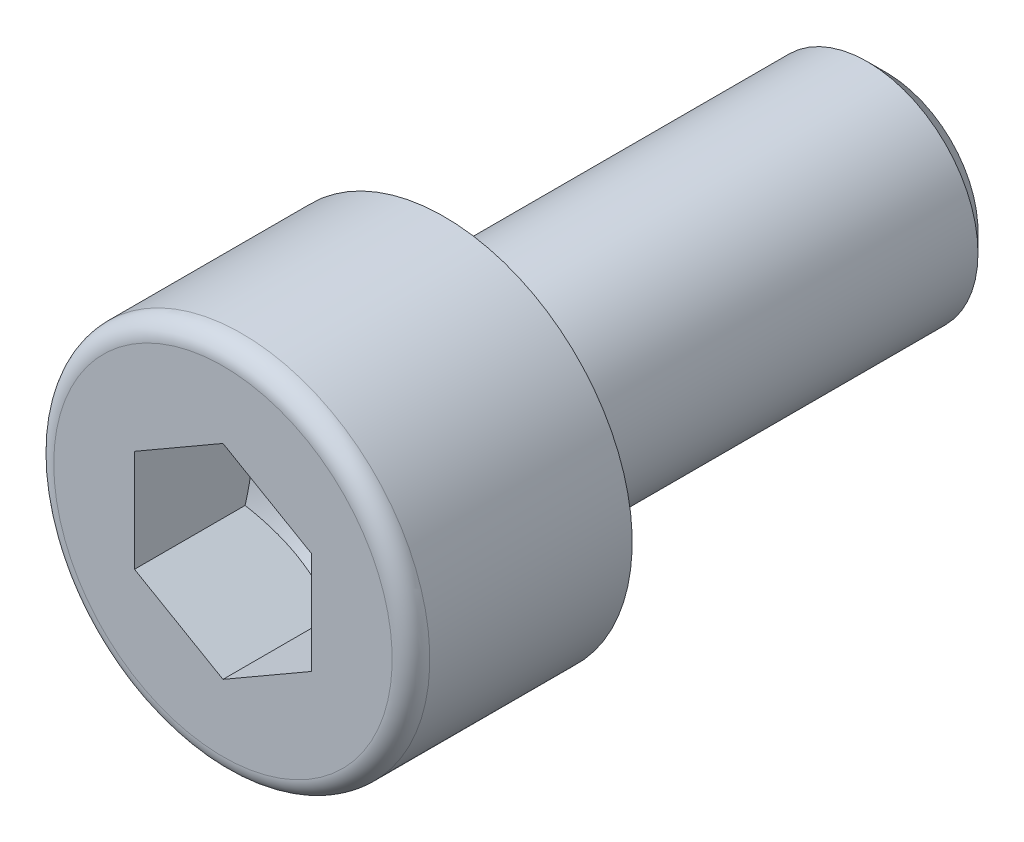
ISO-10303-21;
HEADER;
FILE_DESCRIPTION(('STEP AP214'),'2;1');
FILE_NAME('part.step','',(''),(''),'','','');
FILE_SCHEMA(('AUTOMOTIVE_DESIGN { 1 0 10303 214 1 1 1 1 }'));
ENDSEC;
DATA;
#1=APPLICATION_CONTEXT('core data for automotive mechanical design processes');
#2=APPLICATION_PROTOCOL_DEFINITION('international standard','automotive_design',2000,#1);
#3=PRODUCT_CONTEXT('',#1,'mechanical');
#4=PRODUCT('Part','Part','',(#3));
#5=PRODUCT_RELATED_PRODUCT_CATEGORY('part','',(#4));
#6=PRODUCT_DEFINITION_FORMATION('','',#4);
#7=PRODUCT_DEFINITION_CONTEXT('part definition',#1,'design');
#8=PRODUCT_DEFINITION('design','',#6,#7);
#9=PRODUCT_DEFINITION_SHAPE('','',#8);
#10=(LENGTH_UNIT() NAMED_UNIT(*) SI_UNIT(.MILLI.,.METRE.));
#11=(NAMED_UNIT(*) PLANE_ANGLE_UNIT() SI_UNIT($,.RADIAN.));
#12=(NAMED_UNIT(*) SI_UNIT($,.STERADIAN.) SOLID_ANGLE_UNIT());
#13=UNCERTAINTY_MEASURE_WITH_UNIT(LENGTH_MEASURE(1.E-05),#10,'distance_accuracy_value','');
#14=(GEOMETRIC_REPRESENTATION_CONTEXT(3) GLOBAL_UNCERTAINTY_ASSIGNED_CONTEXT((#13)) GLOBAL_UNIT_ASSIGNED_CONTEXT((#10,
#11,#12)) REPRESENTATION_CONTEXT('',''));
#15=CARTESIAN_POINT('',(0.,0.,0.));
#16=DIRECTION('',(0.,0.,1.));
#17=DIRECTION('',(1.,0.,0.));
#18=AXIS2_PLACEMENT_3D('',#15,#16,#17);
#19=CARTESIAN_POINT('',(-2.125,0.,0.));
#20=DIRECTION('',(0.,0.,-1.));
#21=DIRECTION('',(-1.,0.,0.));
#22=AXIS2_PLACEMENT_3D('',#19,#20,#21);
#23=PLANE('',#22);
#24=CARTESIAN_POINT('',(0.,0.,0.));
#25=DIRECTION('',(0.,0.,-1.));
#26=DIRECTION('',(-1.,0.,0.));
#27=AXIS2_PLACEMENT_3D('',#24,#25,#26);
#28=CIRCLE('',#27,4.25);
#29=CARTESIAN_POINT('',(-4.25,0.,0.));
#30=VERTEX_POINT('',#29);
#31=EDGE_CURVE('E9',#30,#30,#28,.T.);
#32=ORIENTED_EDGE('',*,*,#31,.T.);
#33=EDGE_LOOP('',(#32));
#34=FACE_BOUND('',#33,.T.);
#35=CARTESIAN_POINT('',(0.,0.,0.));
#36=DIRECTION('',(0.,0.,1.));
#37=DIRECTION('',(-1.,0.,0.));
#38=AXIS2_PLACEMENT_3D('',#35,#36,#37);
#39=CIRCLE('',#38,2.5);
#40=CARTESIAN_POINT('',(2.5,0.,0.));
#41=VERTEX_POINT('',#40);
#42=EDGE_CURVE('E120',#41,#41,#39,.T.);
#43=ORIENTED_EDGE('',*,*,#42,.T.);
#44=EDGE_LOOP('',(#43));
#45=FACE_BOUND('',#44,.T.);
#46=ADVANCED_FACE('F15',(#34,#45),#23,.T.);
#47=CARTESIAN_POINT('',(0.,0.,2.2875));
#48=DIRECTION('',(0.,0.,1.));
#49=DIRECTION('',(-1.,0.,0.));
#50=AXIS2_PLACEMENT_3D('',#47,#48,#49);
#51=CYLINDRICAL_SURFACE('',#50,4.25);
#52=CARTESIAN_POINT('',(0.,0.,4.575));
#53=DIRECTION('',(0.,0.,-1.));
#54=DIRECTION('',(-1.,0.,0.));
#55=AXIS2_PLACEMENT_3D('',#52,#53,#54);
#56=CIRCLE('',#55,4.25);
#57=CARTESIAN_POINT('',(-4.25,0.,4.575));
#58=VERTEX_POINT('',#57);
#59=EDGE_CURVE('E25',#58,#58,#56,.T.);
#60=ORIENTED_EDGE('',*,*,#59,.T.);
#61=EDGE_LOOP('',(#60));
#62=FACE_BOUND('',#61,.T.);
#63=ORIENTED_EDGE('',*,*,#31,.F.);
#64=EDGE_LOOP('',(#63));
#65=FACE_BOUND('',#64,.T.);
#66=ADVANCED_FACE('F206',(#62,#65),#51,.T.);
#67=CARTESIAN_POINT('',(0.,0.,4.575));
#68=DIRECTION('',(0.,0.,-1.));
#69=DIRECTION('',(0.,-1.,0.));
#70=AXIS2_PLACEMENT_3D('',#67,#68,#69);
#71=TOROIDAL_SURFACE('',#70,3.825,0.425);
#72=CARTESIAN_POINT('',(0.,0.,5.));
#73=DIRECTION('',(0.,0.,-1.));
#74=DIRECTION('',(-1.,0.,0.));
#75=AXIS2_PLACEMENT_3D('',#72,#73,#74);
#76=CIRCLE('',#75,3.825);
#77=CARTESIAN_POINT('',(-3.825,0.,5.));
#78=VERTEX_POINT('',#77);
#79=EDGE_CURVE('E122',#78,#78,#76,.T.);
#80=ORIENTED_EDGE('',*,*,#79,.T.);
#81=EDGE_LOOP('',(#80));
#82=FACE_BOUND('',#81,.T.);
#83=ORIENTED_EDGE('',*,*,#59,.F.);
#84=EDGE_LOOP('',(#83));
#85=FACE_BOUND('',#84,.T.);
#86=ADVANCED_FACE('F211',(#82,#85),#71,.T.);
#87=CARTESIAN_POINT('',(-1.9125,0.,5.));
#88=DIRECTION('',(0.,0.,1.));
#89=DIRECTION('',(1.,0.,0.));
#90=AXIS2_PLACEMENT_3D('',#87,#88,#89);
#91=PLANE('',#90);
#92=ORIENTED_EDGE('',*,*,#79,.F.);
#93=EDGE_LOOP('',(#92));
#94=FACE_BOUND('',#93,.T.);
#95=DIRECTION('',(-0.866025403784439,-0.5,0.));
#96=VECTOR('',#95,1.);
#97=CARTESIAN_POINT('',(0.282812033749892,-2.14611839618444,5.));
#98=LINE('',#97,#96);
#99=CARTESIAN_POINT('',(1.99999906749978,-1.1547,5.));
#100=VERTEX_POINT('',#99);
#101=CARTESIAN_POINT('',(0.,-2.3094,5.));
#102=VERTEX_POINT('',#101);
#103=EDGE_CURVE('E116',#100,#102,#98,.T.);
#104=ORIENTED_EDGE('',*,*,#103,.T.);
#105=DIRECTION('',(-0.866025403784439,0.5,0.));
#106=VECTOR('',#105,1.);
#107=CARTESIAN_POINT('',(-1.71718703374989,-1.31798160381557,5.));
#108=LINE('',#107,#106);
#109=CARTESIAN_POINT('',(-1.99999906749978,-1.1547,5.));
#110=VERTEX_POINT('',#109);
#111=EDGE_CURVE('E76',#102,#110,#108,.T.);
#112=ORIENTED_EDGE('',*,*,#111,.T.);
#113=DIRECTION('',(0.,1.,0.));
#114=VECTOR('',#113,1.);
#115=CARTESIAN_POINT('',(-1.99999906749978,0.,5.));
#116=LINE('',#115,#114);
#117=CARTESIAN_POINT('',(-1.99999906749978,1.1547,5.));
#118=VERTEX_POINT('',#117);
#119=EDGE_CURVE('E19',#110,#118,#116,.T.);
#120=ORIENTED_EDGE('',*,*,#119,.T.);
#121=DIRECTION('',(0.866025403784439,0.5,0.));
#122=VECTOR('',#121,1.);
#123=CARTESIAN_POINT('',(-1.71718703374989,1.31798160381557,5.));
#124=LINE('',#123,#122);
#125=CARTESIAN_POINT('',(0.,2.3094,5.));
#126=VERTEX_POINT('',#125);
#127=EDGE_CURVE('E106',#118,#126,#124,.T.);
#128=ORIENTED_EDGE('',*,*,#127,.T.);
#129=DIRECTION('',(0.866025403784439,-0.5,0.));
#130=VECTOR('',#129,1.);
#131=CARTESIAN_POINT('',(0.282812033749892,2.14611839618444,5.));
#132=LINE('',#131,#130);
#133=CARTESIAN_POINT('',(1.99999906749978,1.1547,5.));
#134=VERTEX_POINT('',#133);
#135=EDGE_CURVE('E101',#126,#134,#132,.T.);
#136=ORIENTED_EDGE('',*,*,#135,.T.);
#137=DIRECTION('',(0.,-1.,0.));
#138=VECTOR('',#137,1.);
#139=CARTESIAN_POINT('',(1.99999906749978,0.,5.));
#140=LINE('',#139,#138);
#141=EDGE_CURVE('E103',#134,#100,#140,.T.);
#142=ORIENTED_EDGE('',*,*,#141,.T.);
#143=EDGE_LOOP('',(#104,#112,#120,#128,#136,#142));
#144=FACE_BOUND('',#143,.T.);
#145=ADVANCED_FACE('F102',(#94,#144),#91,.T.);
#146=CARTESIAN_POINT('',(-1.0335,0.,-10.));
#147=DIRECTION('',(0.,0.,-1.));
#148=DIRECTION('',(-1.,0.,0.));
#149=AXIS2_PLACEMENT_3D('',#146,#147,#148);
#150=PLANE('',#149);
#151=CARTESIAN_POINT('',(0.,0.,-10.));
#152=DIRECTION('',(0.,0.,-1.));
#153=DIRECTION('',(-1.,0.,0.));
#154=AXIS2_PLACEMENT_3D('',#151,#152,#153);
#155=CIRCLE('',#154,2.067);
#156=CARTESIAN_POINT('',(-2.067,0.,-10.));
#157=VERTEX_POINT('',#156);
#158=EDGE_CURVE('E124',#157,#157,#155,.T.);
#159=ORIENTED_EDGE('',*,*,#158,.T.);
#160=EDGE_LOOP('',(#159));
#161=FACE_BOUND('',#160,.T.);
#162=ADVANCED_FACE('F17',(#161),#150,.T.);
#163=CARTESIAN_POINT('',(0.,0.,-9.7835));
#164=DIRECTION('',(0.,0.,1.));
#165=DIRECTION('',(-1.,0.,0.));
#166=AXIS2_PLACEMENT_3D('',#163,#164,#165);
#167=CONICAL_SURFACE('',#166,2.2835,0.785398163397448);
#168=CARTESIAN_POINT('',(0.,0.,-9.567));
#169=DIRECTION('',(0.,0.,-1.));
#170=DIRECTION('',(-1.,0.,0.));
#171=AXIS2_PLACEMENT_3D('',#168,#169,#170);
#172=CIRCLE('',#171,2.5);
#173=CARTESIAN_POINT('',(-2.5,0.,-9.567));
#174=VERTEX_POINT('',#173);
#175=EDGE_CURVE('E130',#174,#174,#172,.T.);
#176=ORIENTED_EDGE('',*,*,#175,.T.);
#177=EDGE_LOOP('',(#176));
#178=FACE_BOUND('',#177,.T.);
#179=ORIENTED_EDGE('',*,*,#158,.F.);
#180=EDGE_LOOP('',(#179));
#181=FACE_BOUND('',#180,.T.);
#182=ADVANCED_FACE('F220',(#178,#181),#167,.T.);
#183=CARTESIAN_POINT('',(0.,0.,-4.2835));
#184=DIRECTION('',(0.,0.,1.));
#185=DIRECTION('',(-1.,0.,0.));
#186=AXIS2_PLACEMENT_3D('',#183,#184,#185);
#187=CYLINDRICAL_SURFACE('',#186,2.5);
#188=ORIENTED_EDGE('',*,*,#42,.F.);
#189=EDGE_LOOP('',(#188));
#190=FACE_BOUND('',#189,.T.);
#191=ORIENTED_EDGE('',*,*,#175,.F.);
#192=EDGE_LOOP('',(#191));
#193=FACE_BOUND('',#192,.T.);
#194=ADVANCED_FACE('F201',(#190,#193),#187,.T.);
#195=CARTESIAN_POINT('',(-0.999999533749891,-1.73205,5.));
#196=DIRECTION('',(-0.5,-0.866025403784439,0.));
#197=DIRECTION('',(-0.866025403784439,0.5,0.));
#198=AXIS2_PLACEMENT_3D('',#195,#196,#197);
#199=PLANE('',#198);
#200=CARTESIAN_POINT('',(0.,-2.3094,2.5));
#201=CARTESIAN_POINT('',(-0.999999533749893,-1.73205,2.16666682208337));
#202=CARTESIAN_POINT('',(-1.99999906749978,-1.1547,2.5));
#203=(BOUNDED_CURVE() B_SPLINE_CURVE(2,(#200,#201,#202),.UNSPECIFIED.,.F.,
.F.) B_SPLINE_CURVE_WITH_KNOTS((3,3),(0.,2.33687118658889),
.UNSPECIFIED.) CURVE() GEOMETRIC_REPRESENTATION_ITEM() RATIONAL_B_SPLINE_CURVE((1.,
1.15470053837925,1.)) REPRESENTATION_ITEM(''));
#204=CARTESIAN_POINT('',(0.,-2.3094,2.5));
#205=VERTEX_POINT('',#204);
#206=CARTESIAN_POINT('',(-1.99999906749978,-1.1547,2.5));
#207=VERTEX_POINT('',#206);
#208=EDGE_CURVE('E142',#205,#207,#203,.T.);
#209=ORIENTED_EDGE('',*,*,#208,.T.);
#210=DIRECTION('',(0.,0.,-1.));
#211=VECTOR('',#210,1.);
#212=CARTESIAN_POINT('',(-1.99999906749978,-1.1547,5.));
#213=LINE('',#212,#211);
#214=EDGE_CURVE('E47',#110,#207,#213,.T.);
#215=ORIENTED_EDGE('',*,*,#214,.F.);
#216=ORIENTED_EDGE('',*,*,#111,.F.);
#217=DIRECTION('',(0.,0.,-1.));
#218=VECTOR('',#217,1.);
#219=CARTESIAN_POINT('',(0.,-2.3094,5.));
#220=LINE('',#219,#218);
#221=EDGE_CURVE('E128',#102,#205,#220,.T.);
#222=ORIENTED_EDGE('',*,*,#221,.T.);
#223=EDGE_LOOP('',(#209,#215,#216,#222));
#224=FACE_BOUND('',#223,.T.);
#225=ADVANCED_FACE('F191',(#224),#199,.F.);
#226=CARTESIAN_POINT('',(-1.99999906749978,0.,5.));
#227=DIRECTION('',(-1.,0.,0.));
#228=DIRECTION('',(0.,1.,0.));
#229=AXIS2_PLACEMENT_3D('',#226,#227,#228);
#230=PLANE('',#229);
#231=CARTESIAN_POINT('',(-1.99999906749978,-1.1547,2.5));
#232=CARTESIAN_POINT('',(-1.99999906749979,0.,2.16666682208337));
#233=CARTESIAN_POINT('',(-1.99999906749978,1.1547,2.5));
#234=(BOUNDED_CURVE() B_SPLINE_CURVE(2,(#231,#232,#233),.UNSPECIFIED.,.F.,
.F.) B_SPLINE_CURVE_WITH_KNOTS((3,3),(0.,2.33687118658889),
.UNSPECIFIED.) CURVE() GEOMETRIC_REPRESENTATION_ITEM() RATIONAL_B_SPLINE_CURVE((1.,
1.15470053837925,1.)) REPRESENTATION_ITEM(''));
#235=CARTESIAN_POINT('',(-1.99999906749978,1.1547,2.5));
#236=VERTEX_POINT('',#235);
#237=EDGE_CURVE('E147',#207,#236,#234,.T.);
#238=ORIENTED_EDGE('',*,*,#237,.T.);
#239=DIRECTION('',(0.,0.,-1.));
#240=VECTOR('',#239,1.);
#241=CARTESIAN_POINT('',(-1.99999906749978,1.1547,5.));
#242=LINE('',#241,#240);
#243=EDGE_CURVE('E156',#118,#236,#242,.T.);
#244=ORIENTED_EDGE('',*,*,#243,.F.);
#245=ORIENTED_EDGE('',*,*,#119,.F.);
#246=ORIENTED_EDGE('',*,*,#214,.T.);
#247=EDGE_LOOP('',(#238,#244,#245,#246));
#248=FACE_BOUND('',#247,.T.);
#249=ADVANCED_FACE('F192',(#248),#230,.F.);
#250=CARTESIAN_POINT('',(-0.999999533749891,1.73205,5.));
#251=DIRECTION('',(-0.5,0.866025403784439,0.));
#252=DIRECTION('',(0.866025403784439,0.5,0.));
#253=AXIS2_PLACEMENT_3D('',#250,#251,#252);
#254=PLANE('',#253);
#255=CARTESIAN_POINT('',(-1.99999906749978,1.1547,2.5));
#256=CARTESIAN_POINT('',(-0.999999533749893,1.73205,2.16666682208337));
#257=CARTESIAN_POINT('',(0.,2.3094,2.5));
#258=(BOUNDED_CURVE() B_SPLINE_CURVE(2,(#255,#256,#257),.UNSPECIFIED.,.F.,
.F.) B_SPLINE_CURVE_WITH_KNOTS((3,3),(0.,2.33687118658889),
.UNSPECIFIED.) CURVE() GEOMETRIC_REPRESENTATION_ITEM() RATIONAL_B_SPLINE_CURVE((1.,
1.15470053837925,1.)) REPRESENTATION_ITEM(''));
#259=CARTESIAN_POINT('',(0.,2.3094,2.5));
#260=VERTEX_POINT('',#259);
#261=EDGE_CURVE('E151',#236,#260,#258,.T.);
#262=ORIENTED_EDGE('',*,*,#261,.T.);
#263=DIRECTION('',(0.,0.,-1.));
#264=VECTOR('',#263,1.);
#265=CARTESIAN_POINT('',(0.,2.3094,5.));
#266=LINE('',#265,#264);
#267=EDGE_CURVE('E58',#126,#260,#266,.T.);
#268=ORIENTED_EDGE('',*,*,#267,.F.);
#269=ORIENTED_EDGE('',*,*,#127,.F.);
#270=ORIENTED_EDGE('',*,*,#243,.T.);
#271=EDGE_LOOP('',(#262,#268,#269,#270));
#272=FACE_BOUND('',#271,.T.);
#273=ADVANCED_FACE('F181',(#272),#254,.F.);
#274=CARTESIAN_POINT('',(0.999999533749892,1.73205,5.));
#275=DIRECTION('',(0.5,0.866025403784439,0.));
#276=DIRECTION('',(0.866025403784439,-0.5,0.));
#277=AXIS2_PLACEMENT_3D('',#274,#275,#276);
#278=PLANE('',#277);
#279=CARTESIAN_POINT('',(0.,2.3094,2.5));
#280=CARTESIAN_POINT('',(0.999999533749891,1.73205,2.16666682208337));
#281=CARTESIAN_POINT('',(1.99999906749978,1.1547,2.5));
#282=(BOUNDED_CURVE() B_SPLINE_CURVE(2,(#279,#280,#281),.UNSPECIFIED.,.F.,
.F.) B_SPLINE_CURVE_WITH_KNOTS((3,3),(0.,2.33687118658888),
.UNSPECIFIED.) CURVE() GEOMETRIC_REPRESENTATION_ITEM() RATIONAL_B_SPLINE_CURVE((1.,
1.15470053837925,1.)) REPRESENTATION_ITEM(''));
#283=CARTESIAN_POINT('',(1.99999906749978,1.1547,2.5));
#284=VERTEX_POINT('',#283);
#285=EDGE_CURVE('E109',#260,#284,#282,.T.);
#286=ORIENTED_EDGE('',*,*,#285,.T.);
#287=DIRECTION('',(0.,0.,-1.));
#288=VECTOR('',#287,1.);
#289=CARTESIAN_POINT('',(1.99999906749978,1.1547,5.));
#290=LINE('',#289,#288);
#291=EDGE_CURVE('E84',#134,#284,#290,.T.);
#292=ORIENTED_EDGE('',*,*,#291,.F.);
#293=ORIENTED_EDGE('',*,*,#135,.F.);
#294=ORIENTED_EDGE('',*,*,#267,.T.);
#295=EDGE_LOOP('',(#286,#292,#293,#294));
#296=FACE_BOUND('',#295,.T.);
#297=ADVANCED_FACE('F108',(#296),#278,.F.);
#298=CARTESIAN_POINT('',(1.99999906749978,0.,5.));
#299=DIRECTION('',(1.,0.,0.));
#300=DIRECTION('',(0.,-1.,0.));
#301=AXIS2_PLACEMENT_3D('',#298,#299,#300);
#302=PLANE('',#301);
#303=CARTESIAN_POINT('',(1.99999906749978,1.1547,2.5));
#304=CARTESIAN_POINT('',(1.99999906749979,0.,2.16666682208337));
#305=CARTESIAN_POINT('',(1.99999906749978,-1.1547,2.5));
#306=(BOUNDED_CURVE() B_SPLINE_CURVE(2,(#303,#304,#305),.UNSPECIFIED.,.F.,
.F.) B_SPLINE_CURVE_WITH_KNOTS((3,3),(0.,2.33687118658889),
.UNSPECIFIED.) CURVE() GEOMETRIC_REPRESENTATION_ITEM() RATIONAL_B_SPLINE_CURVE((1.,
1.15470053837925,1.)) REPRESENTATION_ITEM(''));
#307=CARTESIAN_POINT('',(1.99999906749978,-1.1547,2.5));
#308=VERTEX_POINT('',#307);
#309=EDGE_CURVE('E129',#284,#308,#306,.T.);
#310=ORIENTED_EDGE('',*,*,#309,.T.);
#311=DIRECTION('',(0.,0.,-1.));
#312=VECTOR('',#311,1.);
#313=CARTESIAN_POINT('',(1.99999906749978,-1.1547,5.));
#314=LINE('',#313,#312);
#315=EDGE_CURVE('E113',#100,#308,#314,.T.);
#316=ORIENTED_EDGE('',*,*,#315,.F.);
#317=ORIENTED_EDGE('',*,*,#141,.F.);
#318=ORIENTED_EDGE('',*,*,#291,.T.);
#319=EDGE_LOOP('',(#310,#316,#317,#318));
#320=FACE_BOUND('',#319,.T.);
#321=ADVANCED_FACE('F112',(#320),#302,.F.);
#322=CARTESIAN_POINT('',(0.999999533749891,-1.73205,5.));
#323=DIRECTION('',(0.5,-0.866025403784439,0.));
#324=DIRECTION('',(-0.866025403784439,-0.5,0.));
#325=AXIS2_PLACEMENT_3D('',#322,#323,#324);
#326=PLANE('',#325);
#327=CARTESIAN_POINT('',(1.99999906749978,-1.1547,2.5));
#328=CARTESIAN_POINT('',(0.999999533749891,-1.73205,2.16666682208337));
#329=CARTESIAN_POINT('',(0.,-2.3094,2.5));
#330=(BOUNDED_CURVE() B_SPLINE_CURVE(2,(#327,#328,#329),.UNSPECIFIED.,.F.,
.F.) B_SPLINE_CURVE_WITH_KNOTS((3,3),(0.,2.33687118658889),
.UNSPECIFIED.) CURVE() GEOMETRIC_REPRESENTATION_ITEM() RATIONAL_B_SPLINE_CURVE((1.,
1.15470053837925,1.)) REPRESENTATION_ITEM(''));
#331=EDGE_CURVE('E138',#308,#205,#330,.T.);
#332=ORIENTED_EDGE('',*,*,#331,.T.);
#333=ORIENTED_EDGE('',*,*,#221,.F.);
#334=ORIENTED_EDGE('',*,*,#103,.F.);
#335=ORIENTED_EDGE('',*,*,#315,.T.);
#336=EDGE_LOOP('',(#332,#333,#334,#335));
#337=FACE_BOUND('',#336,.T.);
#338=ADVANCED_FACE('F190',(#337),#326,.F.);
#339=CARTESIAN_POINT('',(0.,0.,1.83333364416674));
#340=DIRECTION('',(0.,0.,1.));
#341=DIRECTION('',(-1.,0.,0.));
#342=AXIS2_PLACEMENT_3D('',#339,#340,#341);
#343=CONICAL_SURFACE('',#342,1.1547,1.0471975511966);
#344=CARTESIAN_POINT('',(0.,0.,1.16666728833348));
#345=VERTEX_POINT('',#344);
#346=VERTEX_LOOP('',#345);
#347=FACE_BOUND('',#346,.T.);
#348=ORIENTED_EDGE('',*,*,#261,.F.);
#349=ORIENTED_EDGE('',*,*,#237,.F.);
#350=ORIENTED_EDGE('',*,*,#208,.F.);
#351=ORIENTED_EDGE('',*,*,#331,.F.);
#352=ORIENTED_EDGE('',*,*,#309,.F.);
#353=ORIENTED_EDGE('',*,*,#285,.F.);
#354=EDGE_LOOP('',(#348,#349,#350,#351,#352,#353));
#355=FACE_BOUND('',#354,.T.);
#356=ADVANCED_FACE('F185',(#347,#355),#343,.F.);
#357=CLOSED_SHELL('',(#46,#66,#86,#145,#162,#182,#194,#225,#249,#273,#297,#321,#338,#356));
#358=MANIFOLD_SOLID_BREP('B1',#357);
#359=ADVANCED_BREP_SHAPE_REPRESENTATION('',(#18,#358),#14);
#360=SHAPE_DEFINITION_REPRESENTATION(#9,#359);
ENDSEC;
END-ISO-10303-21;
